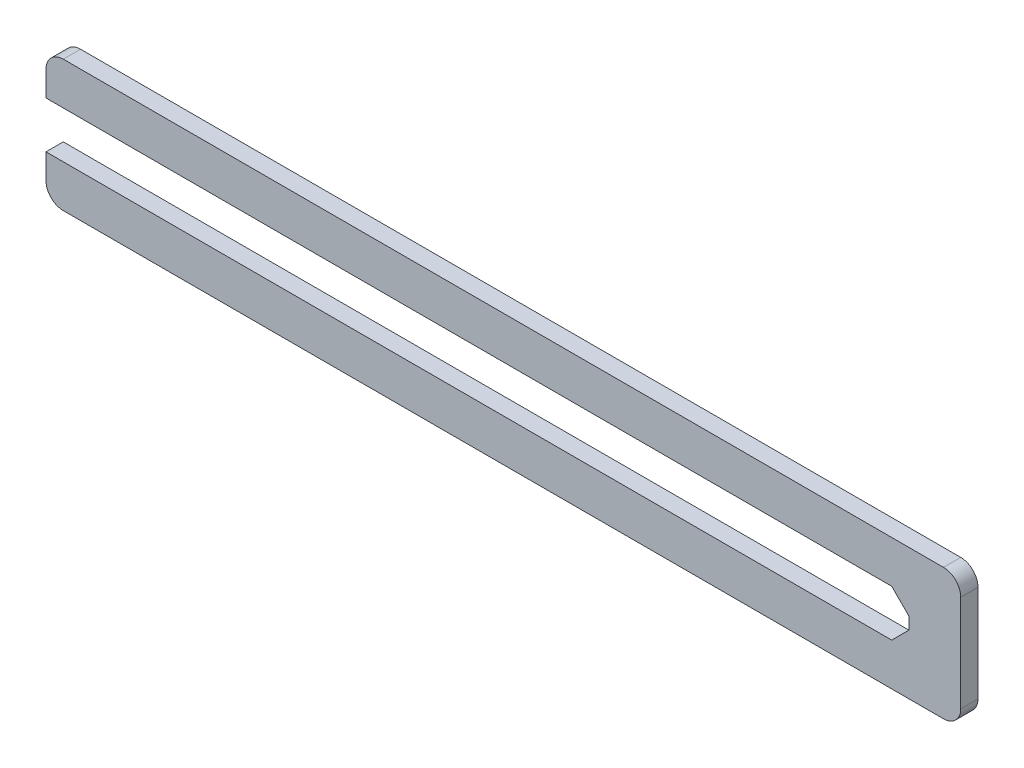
ISO-10303-21;
HEADER;
FILE_DESCRIPTION(('STEP AP214'),'2;1');
FILE_NAME('part.step','',(''),(''),'','','');
FILE_SCHEMA(('AUTOMOTIVE_DESIGN { 1 0 10303 214 1 1 1 1 }'));
ENDSEC;
DATA;
#1=APPLICATION_CONTEXT('core data for automotive mechanical design processes');
#2=APPLICATION_PROTOCOL_DEFINITION('international standard','automotive_design',2000,#1);
#3=PRODUCT_CONTEXT('',#1,'mechanical');
#4=PRODUCT('Part','Part','',(#3));
#5=PRODUCT_RELATED_PRODUCT_CATEGORY('part','',(#4));
#6=PRODUCT_DEFINITION_FORMATION('','',#4);
#7=PRODUCT_DEFINITION_CONTEXT('part definition',#1,'design');
#8=PRODUCT_DEFINITION('design','',#6,#7);
#9=PRODUCT_DEFINITION_SHAPE('','',#8);
#10=(LENGTH_UNIT() NAMED_UNIT(*) SI_UNIT(.MILLI.,.METRE.));
#11=(NAMED_UNIT(*) PLANE_ANGLE_UNIT() SI_UNIT($,.RADIAN.));
#12=(NAMED_UNIT(*) SI_UNIT($,.STERADIAN.) SOLID_ANGLE_UNIT());
#13=UNCERTAINTY_MEASURE_WITH_UNIT(LENGTH_MEASURE(1.E-05),#10,'distance_accuracy_value','');
#14=(GEOMETRIC_REPRESENTATION_CONTEXT(3) GLOBAL_UNCERTAINTY_ASSIGNED_CONTEXT((#13)) GLOBAL_UNIT_ASSIGNED_CONTEXT((#10,
#11,#12)) REPRESENTATION_CONTEXT('',''));
#15=CARTESIAN_POINT('',(0.,0.,0.));
#16=DIRECTION('',(0.,0.,1.));
#17=DIRECTION('',(1.,0.,0.));
#18=AXIS2_PLACEMENT_3D('',#15,#16,#17);
#19=CARTESIAN_POINT('',(0.,0.,5.));
#20=DIRECTION('',(1.,0.,0.));
#21=DIRECTION('',(0.,0.,-1.));
#22=AXIS2_PLACEMENT_3D('',#19,#20,#21);
#23=PLANE('',#22);
#24=DIRECTION('',(0.,-1.,0.));
#25=VECTOR('',#24,1.);
#26=CARTESIAN_POINT('',(0.,0.,5.));
#27=LINE('',#26,#25);
#28=CARTESIAN_POINT('',(0.,33.,5.));
#29=VERTEX_POINT('',#28);
#30=CARTESIAN_POINT('',(0.,25.75,5.));
#31=VERTEX_POINT('',#30);
#32=EDGE_CURVE('E160',#29,#31,#27,.T.);
#33=ORIENTED_EDGE('',*,*,#32,.F.);
#34=DIRECTION('',(0.,0.,-1.));
#35=VECTOR('',#34,1.);
#36=CARTESIAN_POINT('',(0.,33.,5.));
#37=LINE('',#36,#35);
#38=CARTESIAN_POINT('',(0.,33.,0.));
#39=VERTEX_POINT('',#38);
#40=EDGE_CURVE('E213',#29,#39,#37,.T.);
#41=ORIENTED_EDGE('',*,*,#40,.T.);
#42=DIRECTION('',(0.,-1.,0.));
#43=VECTOR('',#42,1.);
#44=CARTESIAN_POINT('',(0.,0.,0.));
#45=LINE('',#44,#43);
#46=CARTESIAN_POINT('',(0.,25.75,0.));
#47=VERTEX_POINT('',#46);
#48=EDGE_CURVE('E174',#39,#47,#45,.T.);
#49=ORIENTED_EDGE('',*,*,#48,.T.);
#50=DIRECTION('',(0.,0.,1.));
#51=VECTOR('',#50,1.);
#52=CARTESIAN_POINT('',(0.,25.75,-1.));
#53=LINE('',#52,#51);
#54=EDGE_CURVE('E243',#47,#31,#53,.T.);
#55=ORIENTED_EDGE('',*,*,#54,.T.);
#56=EDGE_LOOP('',(#33,#41,#49,#55));
#57=FACE_BOUND('',#56,.T.);
#58=ADVANCED_FACE('F32',(#57),#23,.F.);
#59=CARTESIAN_POINT('',(0.,12.25,0.));
#60=VERTEX_POINT('',#59);
#61=CARTESIAN_POINT('',(0.,5.,0.));
#62=VERTEX_POINT('',#61);
#63=EDGE_CURVE('E177',#60,#62,#45,.T.);
#64=ORIENTED_EDGE('',*,*,#63,.T.);
#65=DIRECTION('',(0.,0.,-1.));
#66=VECTOR('',#65,1.);
#67=CARTESIAN_POINT('',(0.,5.,5.));
#68=LINE('',#67,#66);
#69=CARTESIAN_POINT('',(0.,5.,5.));
#70=VERTEX_POINT('',#69);
#71=EDGE_CURVE('E159',#62,#70,#68,.F.);
#72=ORIENTED_EDGE('',*,*,#71,.T.);
#73=CARTESIAN_POINT('',(0.,12.25,5.));
#74=VERTEX_POINT('',#73);
#75=EDGE_CURVE('E151',#74,#70,#27,.T.);
#76=ORIENTED_EDGE('',*,*,#75,.F.);
#77=DIRECTION('',(0.,0.,1.));
#78=VECTOR('',#77,1.);
#79=CARTESIAN_POINT('',(0.,12.25,-1.));
#80=LINE('',#79,#78);
#81=EDGE_CURVE('E135',#60,#74,#80,.T.);
#82=ORIENTED_EDGE('',*,*,#81,.F.);
#83=EDGE_LOOP('',(#64,#72,#76,#82));
#84=FACE_BOUND('',#83,.T.);
#85=ADVANCED_FACE('F157',(#84),#23,.F.);
#86=CARTESIAN_POINT('',(0.,0.,5.));
#87=DIRECTION('',(0.,1.,0.));
#88=DIRECTION('',(0.,0.,1.));
#89=AXIS2_PLACEMENT_3D('',#86,#87,#88);
#90=PLANE('',#89);
#91=DIRECTION('',(1.,0.,0.));
#92=VECTOR('',#91,1.);
#93=CARTESIAN_POINT('',(0.,0.,5.));
#94=LINE('',#93,#92);
#95=CARTESIAN_POINT('',(5.,0.,5.));
#96=VERTEX_POINT('',#95);
#97=CARTESIAN_POINT('',(260.,0.,5.));
#98=VERTEX_POINT('',#97);
#99=EDGE_CURVE('E163',#96,#98,#94,.T.);
#100=ORIENTED_EDGE('',*,*,#99,.F.);
#101=DIRECTION('',(0.,0.,-1.));
#102=VECTOR('',#101,1.);
#103=CARTESIAN_POINT('',(5.,0.,5.));
#104=LINE('',#103,#102);
#105=CARTESIAN_POINT('',(5.,0.,0.));
#106=VERTEX_POINT('',#105);
#107=EDGE_CURVE('E194',#96,#106,#104,.T.);
#108=ORIENTED_EDGE('',*,*,#107,.T.);
#109=DIRECTION('',(1.,0.,0.));
#110=VECTOR('',#109,1.);
#111=CARTESIAN_POINT('',(0.,0.,0.));
#112=LINE('',#111,#110);
#113=CARTESIAN_POINT('',(260.,0.,0.));
#114=VERTEX_POINT('',#113);
#115=EDGE_CURVE('E176',#106,#114,#112,.T.);
#116=ORIENTED_EDGE('',*,*,#115,.T.);
#117=DIRECTION('',(0.,0.,-1.));
#118=VECTOR('',#117,1.);
#119=CARTESIAN_POINT('',(260.,0.,5.));
#120=LINE('',#119,#118);
#121=EDGE_CURVE('E192',#114,#98,#120,.F.);
#122=ORIENTED_EDGE('',*,*,#121,.T.);
#123=EDGE_LOOP('',(#100,#108,#116,#122));
#124=FACE_BOUND('',#123,.T.);
#125=ADVANCED_FACE('F273',(#124),#90,.F.);
#126=CARTESIAN_POINT('',(265.,0.,5.));
#127=DIRECTION('',(-1.,0.,0.));
#128=DIRECTION('',(0.,0.,1.));
#129=AXIS2_PLACEMENT_3D('',#126,#127,#128);
#130=PLANE('',#129);
#131=DIRECTION('',(0.,1.,0.));
#132=VECTOR('',#131,1.);
#133=CARTESIAN_POINT('',(265.,0.,5.));
#134=LINE('',#133,#132);
#135=CARTESIAN_POINT('',(265.,5.,5.));
#136=VERTEX_POINT('',#135);
#137=CARTESIAN_POINT('',(265.,33.,5.));
#138=VERTEX_POINT('',#137);
#139=EDGE_CURVE('E170',#136,#138,#134,.T.);
#140=ORIENTED_EDGE('',*,*,#139,.F.);
#141=DIRECTION('',(0.,0.,-1.));
#142=VECTOR('',#141,1.);
#143=CARTESIAN_POINT('',(265.,5.,5.));
#144=LINE('',#143,#142);
#145=CARTESIAN_POINT('',(265.,5.,0.));
#146=VERTEX_POINT('',#145);
#147=EDGE_CURVE('E11',#136,#146,#144,.T.);
#148=ORIENTED_EDGE('',*,*,#147,.T.);
#149=DIRECTION('',(0.,1.,0.));
#150=VECTOR('',#149,1.);
#151=CARTESIAN_POINT('',(265.,0.,0.));
#152=LINE('',#151,#150);
#153=CARTESIAN_POINT('',(265.,33.,0.));
#154=VERTEX_POINT('',#153);
#155=EDGE_CURVE('E164',#146,#154,#152,.T.);
#156=ORIENTED_EDGE('',*,*,#155,.T.);
#157=DIRECTION('',(0.,0.,-1.));
#158=VECTOR('',#157,1.);
#159=CARTESIAN_POINT('',(265.,33.,5.));
#160=LINE('',#159,#158);
#161=EDGE_CURVE('E40',#154,#138,#160,.F.);
#162=ORIENTED_EDGE('',*,*,#161,.T.);
#163=EDGE_LOOP('',(#140,#148,#156,#162));
#164=FACE_BOUND('',#163,.T.);
#165=ADVANCED_FACE('F222',(#164),#130,.F.);
#166=CARTESIAN_POINT('',(0.,38.,5.));
#167=DIRECTION('',(0.,-1.,0.));
#168=DIRECTION('',(0.,0.,-1.));
#169=AXIS2_PLACEMENT_3D('',#166,#167,#168);
#170=PLANE('',#169);
#171=DIRECTION('',(-1.,0.,0.));
#172=VECTOR('',#171,1.);
#173=CARTESIAN_POINT('',(0.,38.,0.));
#174=LINE('',#173,#172);
#175=CARTESIAN_POINT('',(260.,38.,0.));
#176=VERTEX_POINT('',#175);
#177=CARTESIAN_POINT('',(5.,38.,0.));
#178=VERTEX_POINT('',#177);
#179=EDGE_CURVE('E161',#176,#178,#174,.T.);
#180=ORIENTED_EDGE('',*,*,#179,.T.);
#181=DIRECTION('',(0.,0.,-1.));
#182=VECTOR('',#181,1.);
#183=CARTESIAN_POINT('',(5.,38.,5.));
#184=LINE('',#183,#182);
#185=CARTESIAN_POINT('',(5.,38.,5.));
#186=VERTEX_POINT('',#185);
#187=EDGE_CURVE('E47',#178,#186,#184,.F.);
#188=ORIENTED_EDGE('',*,*,#187,.T.);
#189=DIRECTION('',(-1.,0.,0.));
#190=VECTOR('',#189,1.);
#191=CARTESIAN_POINT('',(0.,38.,5.));
#192=LINE('',#191,#190);
#193=CARTESIAN_POINT('',(260.,38.,5.));
#194=VERTEX_POINT('',#193);
#195=EDGE_CURVE('E172',#194,#186,#192,.T.);
#196=ORIENTED_EDGE('',*,*,#195,.F.);
#197=DIRECTION('',(0.,0.,-1.));
#198=VECTOR('',#197,1.);
#199=CARTESIAN_POINT('',(260.,38.,5.));
#200=LINE('',#199,#198);
#201=EDGE_CURVE('E216',#194,#176,#200,.T.);
#202=ORIENTED_EDGE('',*,*,#201,.T.);
#203=EDGE_LOOP('',(#180,#188,#196,#202));
#204=FACE_BOUND('',#203,.T.);
#205=ADVANCED_FACE('F229',(#204),#170,.F.);
#206=CARTESIAN_POINT('',(0.,38.,5.));
#207=DIRECTION('',(0.,0.,-1.));
#208=DIRECTION('',(-1.,0.,0.));
#209=AXIS2_PLACEMENT_3D('',#206,#207,#208);
#210=PLANE('',#209);
#211=ORIENTED_EDGE('',*,*,#75,.T.);
#212=CARTESIAN_POINT('',(5.,5.,5.));
#213=DIRECTION('',(0.,0.,-1.));
#214=DIRECTION('',(-1.,0.,0.));
#215=AXIS2_PLACEMENT_3D('',#212,#213,#214);
#216=CIRCLE('',#215,5.);
#217=EDGE_CURVE('E211',#70,#96,#216,.F.);
#218=ORIENTED_EDGE('',*,*,#217,.T.);
#219=ORIENTED_EDGE('',*,*,#99,.T.);
#220=CARTESIAN_POINT('',(260.,5.,5.));
#221=DIRECTION('',(0.,0.,-1.));
#222=DIRECTION('',(-1.,0.,0.));
#223=AXIS2_PLACEMENT_3D('',#220,#221,#222);
#224=CIRCLE('',#223,5.);
#225=EDGE_CURVE('E207',#98,#136,#224,.F.);
#226=ORIENTED_EDGE('',*,*,#225,.T.);
#227=ORIENTED_EDGE('',*,*,#139,.T.);
#228=CARTESIAN_POINT('',(260.,33.,5.));
#229=DIRECTION('',(0.,0.,-1.));
#230=DIRECTION('',(-1.,0.,0.));
#231=AXIS2_PLACEMENT_3D('',#228,#229,#230);
#232=CIRCLE('',#231,5.);
#233=EDGE_CURVE('E54',#138,#194,#232,.F.);
#234=ORIENTED_EDGE('',*,*,#233,.T.);
#235=ORIENTED_EDGE('',*,*,#195,.T.);
#236=CARTESIAN_POINT('',(5.,33.,5.));
#237=DIRECTION('',(0.,0.,-1.));
#238=DIRECTION('',(-1.,0.,0.));
#239=AXIS2_PLACEMENT_3D('',#236,#237,#238);
#240=CIRCLE('',#239,5.);
#241=EDGE_CURVE('E209',#186,#29,#240,.F.);
#242=ORIENTED_EDGE('',*,*,#241,.T.);
#243=ORIENTED_EDGE('',*,*,#32,.T.);
#244=DIRECTION('',(-1.,0.,0.));
#245=VECTOR('',#244,1.);
#246=CARTESIAN_POINT('',(0.,25.75,5.));
#247=LINE('',#246,#245);
#248=CARTESIAN_POINT('',(245.,25.75,5.));
#249=VERTEX_POINT('',#248);
#250=EDGE_CURVE('E147',#249,#31,#247,.T.);
#251=ORIENTED_EDGE('',*,*,#250,.F.);
#252=DIRECTION('',(-0.707106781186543,0.707106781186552,0.));
#253=VECTOR('',#252,1.);
#254=CARTESIAN_POINT('',(245.,25.75,5.));
#255=LINE('',#254,#253);
#256=CARTESIAN_POINT('',(250.,20.75,5.));
#257=VERTEX_POINT('',#256);
#258=EDGE_CURVE('E252',#257,#249,#255,.T.);
#259=ORIENTED_EDGE('',*,*,#258,.F.);
#260=DIRECTION('',(0.,1.,0.));
#261=VECTOR('',#260,1.);
#262=CARTESIAN_POINT('',(250.,20.75,5.));
#263=LINE('',#262,#261);
#264=CARTESIAN_POINT('',(250.,17.25,5.));
#265=VERTEX_POINT('',#264);
#266=EDGE_CURVE('E254',#265,#257,#263,.T.);
#267=ORIENTED_EDGE('',*,*,#266,.F.);
#268=DIRECTION('',(0.707106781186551,0.707106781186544,0.));
#269=VECTOR('',#268,1.);
#270=CARTESIAN_POINT('',(250.,17.25,5.));
#271=LINE('',#270,#269);
#272=CARTESIAN_POINT('',(245.,12.25,5.));
#273=VERTEX_POINT('',#272);
#274=EDGE_CURVE('E155',#273,#265,#271,.T.);
#275=ORIENTED_EDGE('',*,*,#274,.F.);
#276=DIRECTION('',(1.,0.,0.));
#277=VECTOR('',#276,1.);
#278=CARTESIAN_POINT('',(0.,12.25,5.));
#279=LINE('',#278,#277);
#280=EDGE_CURVE('E138',#74,#273,#279,.T.);
#281=ORIENTED_EDGE('',*,*,#280,.F.);
#282=EDGE_LOOP('',(#211,#218,#219,#226,#227,#234,#235,#242,#243,#251,#259,#267,#275,#281));
#283=FACE_BOUND('',#282,.T.);
#284=ADVANCED_FACE('F150',(#283),#210,.F.);
#285=CARTESIAN_POINT('',(0.,38.,0.));
#286=DIRECTION('',(0.,0.,-1.));
#287=DIRECTION('',(-1.,0.,0.));
#288=AXIS2_PLACEMENT_3D('',#285,#286,#287);
#289=PLANE('',#288);
#290=ORIENTED_EDGE('',*,*,#115,.F.);
#291=CARTESIAN_POINT('',(5.,5.,0.));
#292=DIRECTION('',(0.,0.,-1.));
#293=DIRECTION('',(-1.,0.,0.));
#294=AXIS2_PLACEMENT_3D('',#291,#292,#293);
#295=CIRCLE('',#294,5.);
#296=EDGE_CURVE('E203',#106,#62,#295,.T.);
#297=ORIENTED_EDGE('',*,*,#296,.T.);
#298=ORIENTED_EDGE('',*,*,#63,.F.);
#299=DIRECTION('',(-1.,0.,0.));
#300=VECTOR('',#299,1.);
#301=CARTESIAN_POINT('',(0.,12.25,0.));
#302=LINE('',#301,#300);
#303=CARTESIAN_POINT('',(245.,12.25,0.));
#304=VERTEX_POINT('',#303);
#305=EDGE_CURVE('E141',#304,#60,#302,.T.);
#306=ORIENTED_EDGE('',*,*,#305,.F.);
#307=DIRECTION('',(-0.707106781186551,-0.707106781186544,0.));
#308=VECTOR('',#307,1.);
#309=CARTESIAN_POINT('',(135.374999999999,-97.3750000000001,0.));
#310=LINE('',#309,#308);
#311=CARTESIAN_POINT('',(250.,17.25,0.));
#312=VERTEX_POINT('',#311);
#313=EDGE_CURVE('E183',#312,#304,#310,.T.);
#314=ORIENTED_EDGE('',*,*,#313,.F.);
#315=DIRECTION('',(0.,-1.,0.));
#316=VECTOR('',#315,1.);
#317=CARTESIAN_POINT('',(250.,38.,0.));
#318=LINE('',#317,#316);
#319=CARTESIAN_POINT('',(250.,20.75,0.));
#320=VERTEX_POINT('',#319);
#321=EDGE_CURVE('E186',#320,#312,#318,.T.);
#322=ORIENTED_EDGE('',*,*,#321,.F.);
#323=DIRECTION('',(0.707106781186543,-0.707106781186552,0.));
#324=VECTOR('',#323,1.);
#325=CARTESIAN_POINT('',(116.375000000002,154.375,0.));
#326=LINE('',#325,#324);
#327=CARTESIAN_POINT('',(245.,25.75,0.));
#328=VERTEX_POINT('',#327);
#329=EDGE_CURVE('E188',#328,#320,#326,.T.);
#330=ORIENTED_EDGE('',*,*,#329,.F.);
#331=DIRECTION('',(1.,0.,0.));
#332=VECTOR('',#331,1.);
#333=CARTESIAN_POINT('',(0.,25.75,0.));
#334=LINE('',#333,#332);
#335=EDGE_CURVE('E190',#47,#328,#334,.T.);
#336=ORIENTED_EDGE('',*,*,#335,.F.);
#337=ORIENTED_EDGE('',*,*,#48,.F.);
#338=CARTESIAN_POINT('',(5.,33.,0.));
#339=DIRECTION('',(0.,0.,-1.));
#340=DIRECTION('',(-1.,0.,0.));
#341=AXIS2_PLACEMENT_3D('',#338,#339,#340);
#342=CIRCLE('',#341,5.);
#343=EDGE_CURVE('E201',#39,#178,#342,.T.);
#344=ORIENTED_EDGE('',*,*,#343,.T.);
#345=ORIENTED_EDGE('',*,*,#179,.F.);
#346=CARTESIAN_POINT('',(260.,33.,0.));
#347=DIRECTION('',(0.,0.,-1.));
#348=DIRECTION('',(-1.,0.,0.));
#349=AXIS2_PLACEMENT_3D('',#346,#347,#348);
#350=CIRCLE('',#349,5.);
#351=EDGE_CURVE('E197',#176,#154,#350,.T.);
#352=ORIENTED_EDGE('',*,*,#351,.T.);
#353=ORIENTED_EDGE('',*,*,#155,.F.);
#354=CARTESIAN_POINT('',(260.,5.,0.));
#355=DIRECTION('',(0.,0.,-1.));
#356=DIRECTION('',(-1.,0.,0.));
#357=AXIS2_PLACEMENT_3D('',#354,#355,#356);
#358=CIRCLE('',#357,5.);
#359=EDGE_CURVE('E199',#146,#114,#358,.T.);
#360=ORIENTED_EDGE('',*,*,#359,.T.);
#361=EDGE_LOOP('',(#290,#297,#298,#306,#314,#322,#330,#336,#337,#344,#345,#352,#353,#360));
#362=FACE_BOUND('',#361,.T.);
#363=ADVANCED_FACE('F232',(#362),#289,.T.);
#364=CARTESIAN_POINT('',(0.,25.75,-1.));
#365=DIRECTION('',(0.,1.,0.));
#366=DIRECTION('',(0.,0.,1.));
#367=AXIS2_PLACEMENT_3D('',#364,#365,#366);
#368=PLANE('',#367);
#369=ORIENTED_EDGE('',*,*,#335,.T.);
#370=DIRECTION('',(0.,0.,1.));
#371=VECTOR('',#370,1.);
#372=CARTESIAN_POINT('',(245.,25.75,-1.));
#373=LINE('',#372,#371);
#374=EDGE_CURVE('E250',#328,#249,#373,.T.);
#375=ORIENTED_EDGE('',*,*,#374,.T.);
#376=ORIENTED_EDGE('',*,*,#250,.T.);
#377=ORIENTED_EDGE('',*,*,#54,.F.);
#378=EDGE_LOOP('',(#369,#375,#376,#377));
#379=FACE_BOUND('',#378,.T.);
#380=ADVANCED_FACE('F248',(#379),#368,.F.);
#381=CARTESIAN_POINT('',(245.,25.75,-1.));
#382=DIRECTION('',(0.707106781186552,0.707106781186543,0.));
#383=DIRECTION('',(-0.707106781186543,0.707106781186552,0.));
#384=AXIS2_PLACEMENT_3D('',#381,#382,#383);
#385=PLANE('',#384);
#386=ORIENTED_EDGE('',*,*,#329,.T.);
#387=DIRECTION('',(0.,0.,1.));
#388=VECTOR('',#387,1.);
#389=CARTESIAN_POINT('',(250.,20.75,-1.));
#390=LINE('',#389,#388);
#391=EDGE_CURVE('E260',#320,#257,#390,.T.);
#392=ORIENTED_EDGE('',*,*,#391,.T.);
#393=ORIENTED_EDGE('',*,*,#258,.T.);
#394=ORIENTED_EDGE('',*,*,#374,.F.);
#395=EDGE_LOOP('',(#386,#392,#393,#394));
#396=FACE_BOUND('',#395,.T.);
#397=ADVANCED_FACE('F344',(#396),#385,.F.);
#398=CARTESIAN_POINT('',(250.,20.75,-1.));
#399=DIRECTION('',(1.,0.,0.));
#400=DIRECTION('',(0.,0.,-1.));
#401=AXIS2_PLACEMENT_3D('',#398,#399,#400);
#402=PLANE('',#401);
#403=ORIENTED_EDGE('',*,*,#321,.T.);
#404=DIRECTION('',(0.,0.,1.));
#405=VECTOR('',#404,1.);
#406=CARTESIAN_POINT('',(250.,17.25,-1.));
#407=LINE('',#406,#405);
#408=EDGE_CURVE('E262',#312,#265,#407,.T.);
#409=ORIENTED_EDGE('',*,*,#408,.T.);
#410=ORIENTED_EDGE('',*,*,#266,.T.);
#411=ORIENTED_EDGE('',*,*,#391,.F.);
#412=EDGE_LOOP('',(#403,#409,#410,#411));
#413=FACE_BOUND('',#412,.T.);
#414=ADVANCED_FACE('F299',(#413),#402,.F.);
#415=CARTESIAN_POINT('',(250.,17.25,-1.));
#416=DIRECTION('',(0.707106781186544,-0.707106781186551,0.));
#417=DIRECTION('',(0.707106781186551,0.707106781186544,0.));
#418=AXIS2_PLACEMENT_3D('',#415,#416,#417);
#419=PLANE('',#418);
#420=ORIENTED_EDGE('',*,*,#313,.T.);
#421=DIRECTION('',(0.,0.,1.));
#422=VECTOR('',#421,1.);
#423=CARTESIAN_POINT('',(245.,12.25,-1.));
#424=LINE('',#423,#422);
#425=EDGE_CURVE('E146',#304,#273,#424,.T.);
#426=ORIENTED_EDGE('',*,*,#425,.T.);
#427=ORIENTED_EDGE('',*,*,#274,.T.);
#428=ORIENTED_EDGE('',*,*,#408,.F.);
#429=EDGE_LOOP('',(#420,#426,#427,#428));
#430=FACE_BOUND('',#429,.T.);
#431=ADVANCED_FACE('F264',(#430),#419,.F.);
#432=CARTESIAN_POINT('',(0.,12.25,-1.));
#433=DIRECTION('',(0.,-1.,0.));
#434=DIRECTION('',(0.,0.,-1.));
#435=AXIS2_PLACEMENT_3D('',#432,#433,#434);
#436=PLANE('',#435);
#437=ORIENTED_EDGE('',*,*,#305,.T.);
#438=ORIENTED_EDGE('',*,*,#81,.T.);
#439=ORIENTED_EDGE('',*,*,#280,.T.);
#440=ORIENTED_EDGE('',*,*,#425,.F.);
#441=EDGE_LOOP('',(#437,#438,#439,#440));
#442=FACE_BOUND('',#441,.T.);
#443=ADVANCED_FACE('F137',(#442),#436,.F.);
#444=CARTESIAN_POINT('',(5.,5.,5.));
#445=DIRECTION('',(0.,0.,-1.));
#446=DIRECTION('',(-1.,0.,0.));
#447=AXIS2_PLACEMENT_3D('',#444,#445,#446);
#448=CYLINDRICAL_SURFACE('',#447,5.);
#449=ORIENTED_EDGE('',*,*,#217,.F.);
#450=ORIENTED_EDGE('',*,*,#71,.F.);
#451=ORIENTED_EDGE('',*,*,#296,.F.);
#452=ORIENTED_EDGE('',*,*,#107,.F.);
#453=EDGE_LOOP('',(#449,#450,#451,#452));
#454=FACE_BOUND('',#453,.T.);
#455=ADVANCED_FACE('F269',(#454),#448,.T.);
#456=CARTESIAN_POINT('',(5.,33.,5.));
#457=DIRECTION('',(0.,0.,-1.));
#458=DIRECTION('',(-1.,0.,0.));
#459=AXIS2_PLACEMENT_3D('',#456,#457,#458);
#460=CYLINDRICAL_SURFACE('',#459,5.);
#461=ORIENTED_EDGE('',*,*,#241,.F.);
#462=ORIENTED_EDGE('',*,*,#187,.F.);
#463=ORIENTED_EDGE('',*,*,#343,.F.);
#464=ORIENTED_EDGE('',*,*,#40,.F.);
#465=EDGE_LOOP('',(#461,#462,#463,#464));
#466=FACE_BOUND('',#465,.T.);
#467=ADVANCED_FACE('F238',(#466),#460,.T.);
#468=CARTESIAN_POINT('',(260.,5.,5.));
#469=DIRECTION('',(0.,0.,-1.));
#470=DIRECTION('',(-1.,0.,0.));
#471=AXIS2_PLACEMENT_3D('',#468,#469,#470);
#472=CYLINDRICAL_SURFACE('',#471,5.);
#473=ORIENTED_EDGE('',*,*,#225,.F.);
#474=ORIENTED_EDGE('',*,*,#121,.F.);
#475=ORIENTED_EDGE('',*,*,#359,.F.);
#476=ORIENTED_EDGE('',*,*,#147,.F.);
#477=EDGE_LOOP('',(#473,#474,#475,#476));
#478=FACE_BOUND('',#477,.T.);
#479=ADVANCED_FACE('F276',(#478),#472,.T.);
#480=CARTESIAN_POINT('',(260.,33.,5.));
#481=DIRECTION('',(0.,0.,-1.));
#482=DIRECTION('',(-1.,0.,0.));
#483=AXIS2_PLACEMENT_3D('',#480,#481,#482);
#484=CYLINDRICAL_SURFACE('',#483,5.);
#485=ORIENTED_EDGE('',*,*,#233,.F.);
#486=ORIENTED_EDGE('',*,*,#161,.F.);
#487=ORIENTED_EDGE('',*,*,#351,.F.);
#488=ORIENTED_EDGE('',*,*,#201,.F.);
#489=EDGE_LOOP('',(#485,#486,#487,#488));
#490=FACE_BOUND('',#489,.T.);
#491=ADVANCED_FACE('F34',(#490),#484,.T.);
#492=CLOSED_SHELL('',(#58,#85,#125,#165,#205,#284,#363,#380,#397,#414,#431,#443,#455,#467,#479,#491));
#493=MANIFOLD_SOLID_BREP('B2',#492);
#494=ADVANCED_BREP_SHAPE_REPRESENTATION('',(#18,#493),#14);
#495=SHAPE_DEFINITION_REPRESENTATION(#9,#494);
ENDSEC;
END-ISO-10303-21;
